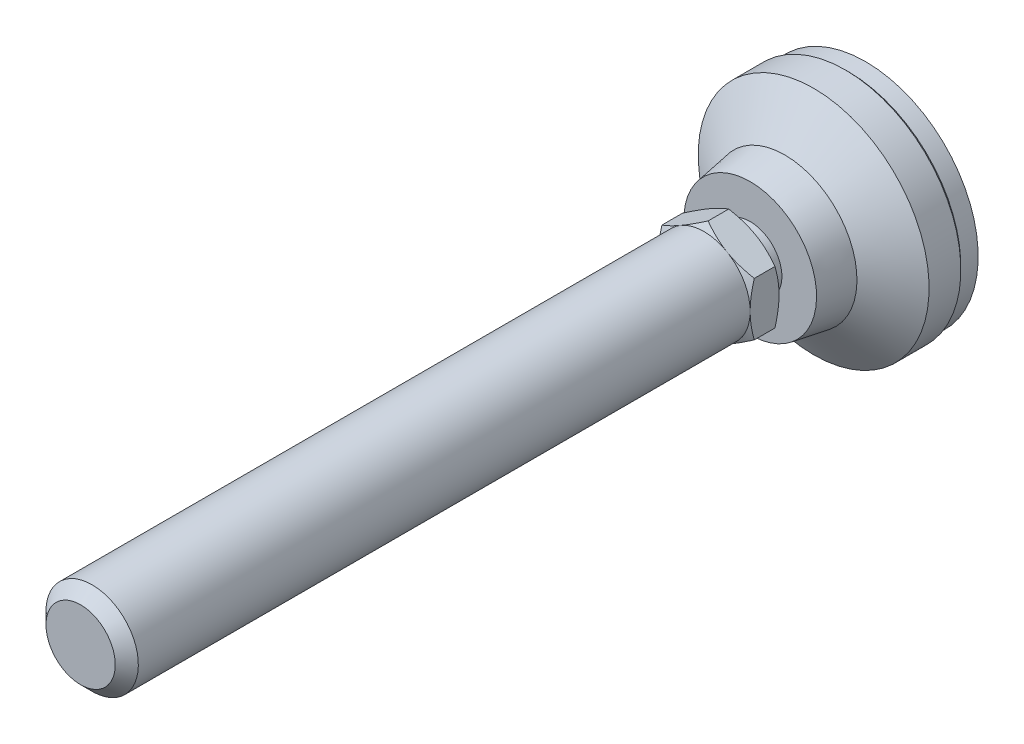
ISO-10303-21;
HEADER;
FILE_DESCRIPTION(('STEP AP214'),'2;1');
FILE_NAME('part.step','',(''),(''),'','','');
FILE_SCHEMA(('AUTOMOTIVE_DESIGN { 1 0 10303 214 1 1 1 1 }'));
ENDSEC;
DATA;
#1=APPLICATION_CONTEXT('core data for automotive mechanical design processes');
#2=APPLICATION_PROTOCOL_DEFINITION('international standard','automotive_design',2000,#1);
#3=PRODUCT_CONTEXT('',#1,'mechanical');
#4=PRODUCT('Part','Part','',(#3));
#5=PRODUCT_RELATED_PRODUCT_CATEGORY('part','',(#4));
#6=PRODUCT_DEFINITION_FORMATION('','',#4);
#7=PRODUCT_DEFINITION_CONTEXT('part definition',#1,'design');
#8=PRODUCT_DEFINITION('design','',#6,#7);
#9=PRODUCT_DEFINITION_SHAPE('','',#8);
#10=(LENGTH_UNIT() NAMED_UNIT(*) SI_UNIT(.MILLI.,.METRE.));
#11=(NAMED_UNIT(*) PLANE_ANGLE_UNIT() SI_UNIT($,.RADIAN.));
#12=(NAMED_UNIT(*) SI_UNIT($,.STERADIAN.) SOLID_ANGLE_UNIT());
#13=UNCERTAINTY_MEASURE_WITH_UNIT(LENGTH_MEASURE(1.E-05),#10,'distance_accuracy_value','');
#14=(GEOMETRIC_REPRESENTATION_CONTEXT(3) GLOBAL_UNCERTAINTY_ASSIGNED_CONTEXT((#13)) GLOBAL_UNIT_ASSIGNED_CONTEXT((#10,
#11,#12)) REPRESENTATION_CONTEXT('',''));
#15=CARTESIAN_POINT('',(0.,0.,0.));
#16=DIRECTION('',(0.,0.,1.));
#17=DIRECTION('',(1.,0.,0.));
#18=AXIS2_PLACEMENT_3D('',#15,#16,#17);
#19=CARTESIAN_POINT('',(0.,0.,2.));
#20=DIRECTION('',(0.,0.,-1.));
#21=DIRECTION('',(0.,1.,0.));
#22=AXIS2_PLACEMENT_3D('',#19,#20,#21);
#23=CYLINDRICAL_SURFACE('',#22,20.);
#24=CARTESIAN_POINT('',(0.,0.,3.5));
#25=DIRECTION('',(0.,0.,-1.));
#26=DIRECTION('',(0.,1.,0.));
#27=AXIS2_PLACEMENT_3D('',#24,#25,#26);
#28=CIRCLE('',#27,20.);
#29=CARTESIAN_POINT('',(0.,20.,3.5));
#30=VERTEX_POINT('',#29);
#31=EDGE_CURVE('E163',#30,#30,#28,.F.);
#32=ORIENTED_EDGE('',*,*,#31,.T.);
#33=EDGE_LOOP('',(#32));
#34=FACE_BOUND('',#33,.T.);
#35=CARTESIAN_POINT('',(0.,0.,9.));
#36=DIRECTION('',(0.,0.,-1.));
#37=DIRECTION('',(0.,1.,0.));
#38=AXIS2_PLACEMENT_3D('',#35,#36,#37);
#39=CIRCLE('',#38,20.);
#40=CARTESIAN_POINT('',(0.,20.,9.));
#41=VERTEX_POINT('',#40);
#42=EDGE_CURVE('E143',#41,#41,#39,.T.);
#43=ORIENTED_EDGE('',*,*,#42,.T.);
#44=EDGE_LOOP('',(#43));
#45=FACE_BOUND('',#44,.T.);
#46=ADVANCED_FACE('F14',(#34,#45),#23,.T.);
#47=CARTESIAN_POINT('',(0.,0.,2.));
#48=DIRECTION('',(0.,0.,-1.));
#49=DIRECTION('',(0.,1.,0.));
#50=AXIS2_PLACEMENT_3D('',#47,#48,#49);
#51=CYLINDRICAL_SURFACE('',#50,5.50000000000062);
#52=CARTESIAN_POINT('',(0.,0.,20.));
#53=DIRECTION('',(0.,0.,-1.));
#54=DIRECTION('',(0.,1.,0.));
#55=AXIS2_PLACEMENT_3D('',#52,#53,#54);
#56=CIRCLE('',#55,5.50000000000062);
#57=CARTESIAN_POINT('',(0.,5.50000000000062,20.));
#58=VERTEX_POINT('',#57);
#59=EDGE_CURVE('E153',#58,#58,#56,.T.);
#60=ORIENTED_EDGE('',*,*,#59,.F.);
#61=EDGE_LOOP('',(#60));
#62=FACE_BOUND('',#61,.T.);
#63=CARTESIAN_POINT('',(0.,0.,22.9999999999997));
#64=DIRECTION('',(0.,0.,-1.));
#65=DIRECTION('',(0.,1.,0.));
#66=AXIS2_PLACEMENT_3D('',#63,#64,#65);
#67=CIRCLE('',#66,5.50000000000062);
#68=CARTESIAN_POINT('',(0.,5.50000000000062,22.9999999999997));
#69=VERTEX_POINT('',#68);
#70=EDGE_CURVE('E134',#69,#69,#67,.T.);
#71=ORIENTED_EDGE('',*,*,#70,.T.);
#72=EDGE_LOOP('',(#71));
#73=FACE_BOUND('',#72,.T.);
#74=ADVANCED_FACE('F293',(#62,#73),#51,.T.);
#75=CARTESIAN_POINT('',(-11.5,0.,20.));
#76=DIRECTION('',(0.,0.,-1.));
#77=DIRECTION('',(0.,1.,0.));
#78=AXIS2_PLACEMENT_3D('',#75,#76,#77);
#79=PLANE('',#78);
#80=CARTESIAN_POINT('',(0.,0.,20.));
#81=DIRECTION('',(0.,0.,-1.));
#82=DIRECTION('',(0.,1.,0.));
#83=AXIS2_PLACEMENT_3D('',#80,#81,#82);
#84=CIRCLE('',#83,11.5);
#85=CARTESIAN_POINT('',(0.,11.5,20.));
#86=VERTEX_POINT('',#85);
#87=EDGE_CURVE('E150',#86,#86,#84,.T.);
#88=ORIENTED_EDGE('',*,*,#87,.F.);
#89=EDGE_LOOP('',(#88));
#90=FACE_BOUND('',#89,.T.);
#91=ORIENTED_EDGE('',*,*,#59,.T.);
#92=EDGE_LOOP('',(#91));
#93=FACE_BOUND('',#92,.T.);
#94=ADVANCED_FACE('F299',(#90,#93),#79,.F.);
#95=CARTESIAN_POINT('',(0.,0.,20.));
#96=DIRECTION('',(0.,0.,-1.));
#97=DIRECTION('',(0.,1.,0.));
#98=AXIS2_PLACEMENT_3D('',#95,#96,#97);
#99=CONICAL_SURFACE('',#98,11.5,0.165148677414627);
#100=CARTESIAN_POINT('',(0.,0.,14.));
#101=DIRECTION('',(0.,0.,-1.));
#102=DIRECTION('',(0.,1.,0.));
#103=AXIS2_PLACEMENT_3D('',#100,#101,#102);
#104=CIRCLE('',#103,12.5);
#105=CARTESIAN_POINT('',(0.,12.5,14.));
#106=VERTEX_POINT('',#105);
#107=EDGE_CURVE('E146',#106,#106,#104,.T.);
#108=ORIENTED_EDGE('',*,*,#107,.F.);
#109=EDGE_LOOP('',(#108));
#110=FACE_BOUND('',#109,.T.);
#111=ORIENTED_EDGE('',*,*,#87,.T.);
#112=EDGE_LOOP('',(#111));
#113=FACE_BOUND('',#112,.T.);
#114=ADVANCED_FACE('F308',(#110,#113),#99,.T.);
#115=CARTESIAN_POINT('',(0.,0.,14.));
#116=DIRECTION('',(0.,0.,-1.));
#117=DIRECTION('',(0.,1.,0.));
#118=AXIS2_PLACEMENT_3D('',#115,#116,#117);
#119=CONICAL_SURFACE('',#118,12.5,0.982793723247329);
#120=ORIENTED_EDGE('',*,*,#42,.F.);
#121=EDGE_LOOP('',(#120));
#122=FACE_BOUND('',#121,.T.);
#123=ORIENTED_EDGE('',*,*,#107,.T.);
#124=EDGE_LOOP('',(#123));
#125=FACE_BOUND('',#124,.T.);
#126=ADVANCED_FACE('F304',(#122,#125),#119,.T.);
#127=CARTESIAN_POINT('',(0.,-5.50000000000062,22.9999999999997));
#128=DIRECTION('',(0.,0.,-1.));
#129=DIRECTION('',(0.,1.,0.));
#130=AXIS2_PLACEMENT_3D('',#127,#128,#129);
#131=PLANE('',#130);
#132=CARTESIAN_POINT('',(0.,0.,22.9999999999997));
#133=DIRECTION('',(0.,0.,1.));
#134=DIRECTION('',(0.,-1.,0.));
#135=AXIS2_PLACEMENT_3D('',#132,#133,#134);
#136=CIRCLE('',#135,8.00000000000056);
#137=CARTESIAN_POINT('',(-4.,6.92820323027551,22.9999999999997));
#138=VERTEX_POINT('',#137);
#139=CARTESIAN_POINT('',(-8.,0.,22.9999999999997));
#140=VERTEX_POINT('',#139);
#141=EDGE_CURVE('E374',#138,#140,#136,.T.);
#142=ORIENTED_EDGE('',*,*,#141,.F.);
#143=CARTESIAN_POINT('',(4.,6.92820323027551,22.9999999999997));
#144=VERTEX_POINT('',#143);
#145=EDGE_CURVE('E115',#144,#138,#136,.T.);
#146=ORIENTED_EDGE('',*,*,#145,.F.);
#147=CARTESIAN_POINT('',(8.,0.,22.9999999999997));
#148=VERTEX_POINT('',#147);
#149=EDGE_CURVE('E375',#148,#144,#136,.T.);
#150=ORIENTED_EDGE('',*,*,#149,.F.);
#151=CARTESIAN_POINT('',(4.,-6.92820323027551,22.9999999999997));
#152=VERTEX_POINT('',#151);
#153=EDGE_CURVE('E35',#152,#148,#136,.T.);
#154=ORIENTED_EDGE('',*,*,#153,.F.);
#155=CARTESIAN_POINT('',(-4.,-6.92820323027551,22.9999999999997));
#156=VERTEX_POINT('',#155);
#157=EDGE_CURVE('E43',#156,#152,#136,.T.);
#158=ORIENTED_EDGE('',*,*,#157,.F.);
#159=EDGE_CURVE('E367',#140,#156,#136,.T.);
#160=ORIENTED_EDGE('',*,*,#159,.F.);
#161=EDGE_LOOP('',(#142,#146,#150,#154,#158,#160));
#162=FACE_BOUND('',#161,.T.);
#163=ORIENTED_EDGE('',*,*,#70,.F.);
#164=EDGE_LOOP('',(#163));
#165=FACE_BOUND('',#164,.T.);
#166=ADVANCED_FACE('F307',(#162,#165),#131,.T.);
#167=CARTESIAN_POINT('',(0.,0.,3.));
#168=DIRECTION('',(0.,0.,1.));
#169=DIRECTION('',(0.,-1.,0.));
#170=AXIS2_PLACEMENT_3D('',#167,#168,#169);
#171=CONICAL_SURFACE('',#170,19.5,0.785398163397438);
#172=ORIENTED_EDGE('',*,*,#31,.F.);
#173=EDGE_LOOP('',(#172));
#174=FACE_BOUND('',#173,.T.);
#175=CARTESIAN_POINT('',(0.,0.,3.));
#176=DIRECTION('',(0.,0.,-1.));
#177=DIRECTION('',(0.,1.,0.));
#178=AXIS2_PLACEMENT_3D('',#175,#176,#177);
#179=CIRCLE('',#178,19.5);
#180=CARTESIAN_POINT('',(0.,19.5,3.));
#181=VERTEX_POINT('',#180);
#182=EDGE_CURVE('E160',#181,#181,#179,.T.);
#183=ORIENTED_EDGE('',*,*,#182,.F.);
#184=EDGE_LOOP('',(#183));
#185=FACE_BOUND('',#184,.T.);
#186=ADVANCED_FACE('F16',(#174,#185),#171,.T.);
#187=CARTESIAN_POINT('',(0.,0.,0.));
#188=DIRECTION('',(0.,0.,1.));
#189=DIRECTION('',(0.,-1.,0.));
#190=AXIS2_PLACEMENT_3D('',#187,#188,#189);
#191=CYLINDRICAL_SURFACE('',#190,19.5);
#192=CARTESIAN_POINT('',(0.,0.,0.));
#193=DIRECTION('',(0.,0.,-1.));
#194=DIRECTION('',(0.,1.,0.));
#195=AXIS2_PLACEMENT_3D('',#192,#193,#194);
#196=CIRCLE('',#195,19.5);
#197=CARTESIAN_POINT('',(0.,19.5,0.));
#198=VERTEX_POINT('',#197);
#199=EDGE_CURVE('E406',#198,#198,#196,.T.);
#200=ORIENTED_EDGE('',*,*,#199,.F.);
#201=EDGE_LOOP('',(#200));
#202=FACE_BOUND('',#201,.T.);
#203=ORIENTED_EDGE('',*,*,#182,.T.);
#204=EDGE_LOOP('',(#203));
#205=FACE_BOUND('',#204,.T.);
#206=ADVANCED_FACE('F335',(#202,#205),#191,.T.);
#207=CARTESIAN_POINT('',(0.,0.,0.));
#208=DIRECTION('',(0.,0.,-1.));
#209=DIRECTION('',(0.,1.,0.));
#210=AXIS2_PLACEMENT_3D('',#207,#208,#209);
#211=PLANE('',#210);
#212=ORIENTED_EDGE('',*,*,#199,.T.);
#213=EDGE_LOOP('',(#212));
#214=FACE_BOUND('',#213,.T.);
#215=ADVANCED_FACE('F183',(#214),#211,.T.);
#216=CARTESIAN_POINT('',(0.,0.,22.9999999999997));
#217=DIRECTION('',(0.,0.,1.));
#218=DIRECTION('',(0.,-1.,0.));
#219=AXIS2_PLACEMENT_3D('',#216,#217,#218);
#220=CONICAL_SURFACE('',#219,8.00000000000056,1.0471975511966);
#221=CARTESIAN_POINT('',(-0.00019999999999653,9.23771977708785,23.7145978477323));
#222=CARTESIAN_POINT('',(0.1756487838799,9.13619343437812,23.6559907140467));
#223=CARTESIAN_POINT('',(0.352153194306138,9.03428856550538,23.6000434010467));
#224=CARTESIAN_POINT('',(0.706595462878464,8.82965122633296,23.494201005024));
#225=CARTESIAN_POINT('',(0.884533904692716,8.72691841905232,23.4443085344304));
#226=CARTESIAN_POINT('',(1.42119823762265,8.41707512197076,23.3046927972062));
#227=CARTESIAN_POINT('',(1.78204258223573,8.20874154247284,23.2252811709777));
#228=CARTESIAN_POINT('',(2.32203917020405,7.89697436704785,23.1321616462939));
#229=CARTESIAN_POINT('',(2.49957818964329,7.79447216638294,23.1056345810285));
#230=CARTESIAN_POINT('',(2.8554591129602,7.58900421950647,23.0611531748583));
#231=CARTESIAN_POINT('',(3.03380094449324,7.4860385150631,23.043198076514));
#232=CARTESIAN_POINT('',(3.3907916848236,7.27992981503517,23.0163156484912));
#233=CARTESIAN_POINT('',(3.5694400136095,7.17678715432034,23.0073780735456));
#234=CARTESIAN_POINT('',(3.92690170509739,6.97040655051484,22.9987223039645));
#235=CARTESIAN_POINT('',(4.10571506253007,6.86716861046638,22.9990038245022));
#236=CARTESIAN_POINT('',(4.44001336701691,6.67416139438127,23.0081450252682));
#237=CARTESIAN_POINT('',(4.59552190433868,6.58437849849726,23.0158896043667));
#238=CARTESIAN_POINT('',(4.90617476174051,6.40502298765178,23.0382011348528));
#239=CARTESIAN_POINT('',(5.06131905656,6.31545038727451,23.0527685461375));
#240=CARTESIAN_POINT('',(5.52615131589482,6.04707935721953,23.1063606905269));
#241=CARTESIAN_POINT('',(5.83501648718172,5.86875596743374,23.1552686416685));
#242=CARTESIAN_POINT('',(6.4560232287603,5.51021755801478,23.2775394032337));
#243=CARTESIAN_POINT('',(6.76808554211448,5.3300482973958,23.3514205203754));
#244=CARTESIAN_POINT('',(7.38755648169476,4.97239658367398,23.5191001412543));
#245=CARTESIAN_POINT('',(7.69497304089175,4.79490955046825,23.6128592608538));
#246=CARTESIAN_POINT('',(8.0002,4.61868668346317,23.7145978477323));
#247=B_SPLINE_CURVE_WITH_KNOTS('',3,(#221,#222,#223,#224,#225,#226,#227,#228,#229,#230,#231,
#232,#233,#234,#235,#236,#237,#238,#239,#240,#241,#242,#243,#244,#245,#246),.UNSPECIFIED.,.F.,
.F.,(4,2,2,2,2,2,2,2,2,2,2,2,4),(0.,0.633973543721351,1.26821965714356,2.53934712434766,
3.15934343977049,3.77928496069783,4.39852133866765,5.01773858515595,5.55680239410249,
6.09590254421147,7.17487077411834,8.27776850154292,9.37850115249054),.UNSPECIFIED.);
#248=CARTESIAN_POINT('',(0.,9.23760430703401,23.7145311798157));
#249=VERTEX_POINT('',#248);
#250=EDGE_CURVE('E112',#249,#144,#247,.T.);
#251=ORIENTED_EDGE('',*,*,#250,.T.);
#252=ORIENTED_EDGE('',*,*,#145,.T.);
#253=CARTESIAN_POINT('',(-8.0002,4.61868668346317,23.7145978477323));
#254=CARTESIAN_POINT('',(-7.8243512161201,4.7202130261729,23.6559907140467));
#255=CARTESIAN_POINT('',(-7.64784680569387,4.82211789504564,23.6000434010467));
#256=CARTESIAN_POINT('',(-7.29340453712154,5.02675523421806,23.494201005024));
#257=CARTESIAN_POINT('',(-7.11546609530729,5.1294880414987,23.4443085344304));
#258=CARTESIAN_POINT('',(-6.57880176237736,5.43933133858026,23.3046927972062));
#259=CARTESIAN_POINT('',(-6.21795741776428,5.64766491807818,23.2252811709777));
#260=CARTESIAN_POINT('',(-5.67796082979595,5.95943209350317,23.1321616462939));
#261=CARTESIAN_POINT('',(-5.50042181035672,6.06193429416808,23.1056345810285));
#262=CARTESIAN_POINT('',(-5.1445408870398,6.26740224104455,23.0611531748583));
#263=CARTESIAN_POINT('',(-4.96619905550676,6.37036794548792,23.043198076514));
#264=CARTESIAN_POINT('',(-4.60920831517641,6.57647664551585,23.0163156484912));
#265=CARTESIAN_POINT('',(-4.4305599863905,6.67961930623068,23.0073780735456));
#266=CARTESIAN_POINT('',(-4.07309829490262,6.88599991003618,22.9987223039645));
#267=CARTESIAN_POINT('',(-3.89428493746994,6.98923785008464,22.9990038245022));
#268=CARTESIAN_POINT('',(-3.5599866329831,7.18224506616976,23.0081450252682));
#269=CARTESIAN_POINT('',(-3.40447809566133,7.27202796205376,23.0158896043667));
#270=CARTESIAN_POINT('',(-3.09382523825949,7.45138347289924,23.0382011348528));
#271=CARTESIAN_POINT('',(-2.93868094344,7.54095607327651,23.0527685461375));
#272=CARTESIAN_POINT('',(-2.47384868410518,7.80932710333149,23.1063606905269));
#273=CARTESIAN_POINT('',(-2.16498351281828,7.98765049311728,23.1552686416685));
#274=CARTESIAN_POINT('',(-1.5439767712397,8.34618890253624,23.2775394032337));
#275=CARTESIAN_POINT('',(-1.23191445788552,8.52635816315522,23.3514205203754));
#276=CARTESIAN_POINT('',(-0.612443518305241,8.88400987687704,23.5191001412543));
#277=CARTESIAN_POINT('',(-0.305026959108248,9.06149691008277,23.6128592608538));
#278=CARTESIAN_POINT('',(0.000200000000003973,9.23771977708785,23.7145978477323));
#279=B_SPLINE_CURVE_WITH_KNOTS('',3,(#253,#254,#255,#256,#257,#258,#259,#260,#261,#262,#263,
#264,#265,#266,#267,#268,#269,#270,#271,#272,#273,#274,#275,#276,#277,#278),.UNSPECIFIED.,.F.,
.F.,(4,2,2,2,2,2,2,2,2,2,2,2,4),(0.,0.63397354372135,1.26821965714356,2.53934712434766,
3.15934343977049,3.77928496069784,4.39852133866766,5.01773858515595,5.55680239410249,
6.09590254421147,7.17487077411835,8.27776850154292,9.37850115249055),.UNSPECIFIED.);
#280=EDGE_CURVE('E18',#138,#249,#279,.T.);
#281=ORIENTED_EDGE('',*,*,#280,.T.);
#282=EDGE_LOOP('',(#251,#252,#281));
#283=FACE_BOUND('',#282,.T.);
#284=ADVANCED_FACE('F111',(#283),#220,.T.);
#285=CARTESIAN_POINT('',(-8.,12.3263124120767,26.8652608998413));
#286=CARTESIAN_POINT('',(-8.,11.9775694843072,26.6964140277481));
#287=CARTESIAN_POINT('',(-8.,11.6280173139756,26.5292095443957));
#288=CARTESIAN_POINT('',(-8.,10.926863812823,26.1990107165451));
#289=CARTESIAN_POINT('',(-8.,10.5752621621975,26.0360170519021));
#290=CARTESIAN_POINT('',(-8.,9.86772854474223,25.7143278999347));
#291=CARTESIAN_POINT('',(-8.,9.51178336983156,25.5556613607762));
#292=CARTESIAN_POINT('',(-8.,8.79703376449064,25.2449296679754));
#293=CARTESIAN_POINT('',(-8.,8.43822947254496,25.0928641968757));
#294=CARTESIAN_POINT('',(-8.,7.70591549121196,24.7924548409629));
#295=CARTESIAN_POINT('',(-8.,7.33229660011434,24.6443756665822));
#296=CARTESIAN_POINT('',(-8.,6.58065902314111,24.3596203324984));
#297=CARTESIAN_POINT('',(-8.,6.20263984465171,24.2229454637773));
#298=CARTESIAN_POINT('',(-8.,5.44232968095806,23.96464628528));
#299=CARTESIAN_POINT('',(-8.,5.06004940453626,23.8429907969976));
#300=CARTESIAN_POINT('',(-8.,4.29002015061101,23.61868525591));
#301=CARTESIAN_POINT('',(-8.,3.90227296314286,23.5160291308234));
#302=CARTESIAN_POINT('',(-8.,3.12316558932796,23.3352511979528));
#303=CARTESIAN_POINT('',(-8.,2.73183647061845,23.2569991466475));
#304=CARTESIAN_POINT('',(-8.,2.14134438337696,23.1613507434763));
#305=CARTESIAN_POINT('',(-8.,1.94391546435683,23.1330882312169));
#306=CARTESIAN_POINT('',(-8.,1.54810388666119,23.0843625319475));
#307=CARTESIAN_POINT('',(-8.,1.34972132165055,23.0638985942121));
#308=CARTESIAN_POINT('',(-8.,0.95482390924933,23.031430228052));
#309=CARTESIAN_POINT('',(-8.,0.758317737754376,23.019320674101));
#310=CARTESIAN_POINT('',(-8.,0.364969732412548,23.0034165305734));
#311=CARTESIAN_POINT('',(-8.,0.16812790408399,22.9996218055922));
#312=CARTESIAN_POINT('',(-8.,-0.225540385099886,23.0004376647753));
#313=CARTESIAN_POINT('',(-8.,-0.422366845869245,23.0050482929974));
#314=CARTESIAN_POINT('',(-8.,-0.815652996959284,23.0225635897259));
#315=CARTESIAN_POINT('',(-8.,-1.0121126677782,23.0354686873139));
#316=CARTESIAN_POINT('',(-8.,-1.48673995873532,23.0763953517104));
#317=CARTESIAN_POINT('',(-8.,-1.76456354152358,23.1084896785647));
#318=CARTESIAN_POINT('',(-8.,-2.31808232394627,23.1874957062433));
#319=CARTESIAN_POINT('',(-8.,-2.59377721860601,23.2344094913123));
#320=CARTESIAN_POINT('',(-8.,-3.4173917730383,23.3948866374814));
#321=CARTESIAN_POINT('',(-8.,-3.96151921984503,23.5281544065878));
#322=CARTESIAN_POINT('',(-8.,-4.77500840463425,23.7584087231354));
#323=CARTESIAN_POINT('',(-8.,-5.04861098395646,23.8412670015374));
#324=CARTESIAN_POINT('',(-8.,-5.59315750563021,24.0153800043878));
#325=CARTESIAN_POINT('',(-8.,-5.86410143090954,24.1066347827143));
#326=CARTESIAN_POINT('',(-8.,-6.40341975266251,24.2960941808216));
#327=CARTESIAN_POINT('',(-8.,-6.67179501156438,24.394296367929));
#328=CARTESIAN_POINT('',(-8.,-7.20633641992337,24.5965161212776));
#329=CARTESIAN_POINT('',(-8.,-7.47250259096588,24.7005336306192));
#330=CARTESIAN_POINT('',(-8.,-8.08229087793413,24.9452921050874));
#331=CARTESIAN_POINT('',(-8.,-8.42524129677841,25.0877030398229));
#332=CARTESIAN_POINT('',(-8.,-9.10837038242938,25.3790415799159));
#333=CARTESIAN_POINT('',(-8.,-9.44854890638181,25.5279695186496));
#334=CARTESIAN_POINT('',(-8.,-10.1266267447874,25.8310867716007));
#335=CARTESIAN_POINT('',(-8.,-10.4645256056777,25.9852770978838));
#336=CARTESIAN_POINT('',(-8.,-11.138343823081,26.2979000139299));
#337=CARTESIAN_POINT('',(-8.,-11.474263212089,26.4563325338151));
#338=CARTESIAN_POINT('',(-8.,-12.1447441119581,26.7768201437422));
#339=CARTESIAN_POINT('',(-8.,-12.4793041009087,26.9388784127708));
#340=CARTESIAN_POINT('',(-8.,-13.1470121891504,27.2658803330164));
#341=CARTESIAN_POINT('',(-8.,-13.4801602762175,27.4308240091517));
#342=CARTESIAN_POINT('',(-8.,-14.4778271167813,27.9292484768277));
#343=CARTESIAN_POINT('',(-8.,-15.140554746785,28.2663161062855));
#344=CARTESIAN_POINT('',(-8.,-16.105765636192,28.7635077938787));
#345=CARTESIAN_POINT('',(-8.,-16.4096389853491,28.920950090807));
#346=CARTESIAN_POINT('',(-8.,-17.0167225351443,29.2370965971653));
#347=CARTESIAN_POINT('',(-8.,-17.3199327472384,29.3958007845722));
#348=CARTESIAN_POINT('',(-8.,-18.22872348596,29.8735656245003));
#349=CARTESIAN_POINT('',(-8.,-18.8334414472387,30.1942668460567));
#350=CARTESIAN_POINT('',(-8.,-20.0397084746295,30.8382873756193));
#351=CARTESIAN_POINT('',(-8.,-20.6412616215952,31.1615990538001));
#352=CARTESIAN_POINT('',(-8.,-21.8428985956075,31.8108702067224));
#353=CARTESIAN_POINT('',(-8.,-22.4429824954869,32.1368295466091));
#354=CARTESIAN_POINT('',(-8.,-23.0425200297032,32.4637843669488));
#355=B_SPLINE_CURVE_WITH_KNOTS('',3,(#285,#286,#287,#288,#289,#290,#291,#292,#293,#294,#295,
#296,#297,#298,#299,#300,#301,#302,#303,#304,#305,#306,#307,#308,#309,#310,#311,#312,#313,#314,
#315,#316,#317,#318,#319,#320,#321,#322,#323,#324,#325,#326,#327,#328,#329,#330,#331,#332,#333,
#334,#335,#336,#337,#338,#339,#340,#341,#342,#343,#344,#345,#346,#347,#348,#349,#350,#351,#352,
#353,#354),.UNSPECIFIED.,.F.,.F.,(4,2,2,2,2,2,2,2,2,2,2,2,2,2,2,2,2,2,2,2,2,2,2,2,2,2,2,2,2,2,2,
2,2,2,4),(0.,1.16241643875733,2.32501939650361,3.49408862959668,4.66310157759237,
5.86863817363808,7.07431105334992,8.27743743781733,9.48017863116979,10.6763864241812,
11.274581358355,11.8727186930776,12.4631850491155,13.0536417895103,13.6441016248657,
14.2345920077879,15.0731300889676,15.9117861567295,17.590064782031,18.4476176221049,
19.3051759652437,20.1624355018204,21.0196866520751,22.1336278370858,23.2476260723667,
24.3618397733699,25.4760351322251,26.5912489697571,27.7064724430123,29.9369650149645,
30.9636790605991,31.9903752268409,34.0438440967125,36.0926343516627,38.1413209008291),.UNSPECIFIED.);
#356=CARTESIAN_POINT('',(-8.,4.61880215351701,23.7145311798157));
#357=VERTEX_POINT('',#356);
#358=EDGE_CURVE('E347',#140,#357,#355,.F.);
#359=ORIENTED_EDGE('',*,*,#358,.T.);
#360=EDGE_CURVE('E9',#357,#138,#279,.T.);
#361=ORIENTED_EDGE('',*,*,#360,.T.);
#362=ORIENTED_EDGE('',*,*,#141,.T.);
#363=EDGE_LOOP('',(#359,#361,#362));
#364=FACE_BOUND('',#363,.T.);
#365=ADVANCED_FACE('F181',(#364),#220,.T.);
#366=CARTESIAN_POINT('',(0.000200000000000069,-9.23771977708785,23.7145978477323));
#367=CARTESIAN_POINT('',(-0.175648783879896,-9.13619343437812,23.6559907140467));
#368=CARTESIAN_POINT('',(-0.352153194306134,-9.03428856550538,23.6000434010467));
#369=CARTESIAN_POINT('',(-0.706595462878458,-8.82965122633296,23.494201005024));
#370=CARTESIAN_POINT('',(-0.88453390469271,-8.72691841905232,23.4443085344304));
#371=CARTESIAN_POINT('',(-1.42119823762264,-8.41707512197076,23.3046927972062));
#372=CARTESIAN_POINT('',(-1.78204258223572,-8.20874154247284,23.2252811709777));
#373=CARTESIAN_POINT('',(-2.32203917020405,-7.89697436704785,23.1321616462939));
#374=CARTESIAN_POINT('',(-2.49957818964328,-7.79447216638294,23.1056345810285));
#375=CARTESIAN_POINT('',(-2.8554591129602,-7.58900421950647,23.0611531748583));
#376=CARTESIAN_POINT('',(-3.03380094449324,-7.4860385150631,23.043198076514));
#377=CARTESIAN_POINT('',(-3.39079168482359,-7.27992981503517,23.0163156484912));
#378=CARTESIAN_POINT('',(-3.5694400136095,-7.17678715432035,23.0073780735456));
#379=CARTESIAN_POINT('',(-3.92690170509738,-6.97040655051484,22.9987223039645));
#380=CARTESIAN_POINT('',(-4.10571506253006,-6.86716861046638,22.9990038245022));
#381=CARTESIAN_POINT('',(-4.4400133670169,-6.67416139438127,23.0081450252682));
#382=CARTESIAN_POINT('',(-4.59552190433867,-6.58437849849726,23.0158896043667));
#383=CARTESIAN_POINT('',(-4.90617476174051,-6.40502298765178,23.0382011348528));
#384=CARTESIAN_POINT('',(-5.06131905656,-6.31545038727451,23.0527685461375));
#385=CARTESIAN_POINT('',(-5.52615131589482,-6.04707935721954,23.1063606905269));
#386=CARTESIAN_POINT('',(-5.83501648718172,-5.86875596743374,23.1552686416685));
#387=CARTESIAN_POINT('',(-6.4560232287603,-5.51021755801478,23.2775394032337));
#388=CARTESIAN_POINT('',(-6.76808554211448,-5.3300482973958,23.3514205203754));
#389=CARTESIAN_POINT('',(-7.38755648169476,-4.97239658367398,23.5191001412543));
#390=CARTESIAN_POINT('',(-7.69497304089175,-4.79490955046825,23.6128592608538));
#391=CARTESIAN_POINT('',(-8.0002,-4.61868668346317,23.7145978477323));
#392=B_SPLINE_CURVE_WITH_KNOTS('',3,(#366,#367,#368,#369,#370,#371,#372,#373,#374,#375,#376,
#377,#378,#379,#380,#381,#382,#383,#384,#385,#386,#387,#388,#389,#390,#391),.UNSPECIFIED.,.F.,
.F.,(4,2,2,2,2,2,2,2,2,2,2,2,4),(0.,0.633973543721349,1.26821965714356,2.53934712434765,
3.15934343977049,3.77928496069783,4.39852133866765,5.01773858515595,5.55680239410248,
6.09590254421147,7.17487077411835,8.27776850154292,9.37850115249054),.UNSPECIFIED.);
#393=CARTESIAN_POINT('',(-8.,-4.618802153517,23.7145311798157));
#394=VERTEX_POINT('',#393);
#395=EDGE_CURVE('E354',#156,#394,#392,.T.);
#396=ORIENTED_EDGE('',*,*,#395,.T.);
#397=EDGE_CURVE('E353',#394,#140,#355,.F.);
#398=ORIENTED_EDGE('',*,*,#397,.T.);
#399=ORIENTED_EDGE('',*,*,#159,.T.);
#400=EDGE_LOOP('',(#396,#398,#399));
#401=FACE_BOUND('',#400,.T.);
#402=ADVANCED_FACE('F365',(#401),#220,.T.);
#403=CARTESIAN_POINT('',(8.0002,-4.61868668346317,23.7145978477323));
#404=CARTESIAN_POINT('',(7.8243512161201,-4.7202130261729,23.6559907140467));
#405=CARTESIAN_POINT('',(7.64784680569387,-4.82211789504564,23.6000434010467));
#406=CARTESIAN_POINT('',(7.29340453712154,-5.02675523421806,23.494201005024));
#407=CARTESIAN_POINT('',(7.11546609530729,-5.1294880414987,23.4443085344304));
#408=CARTESIAN_POINT('',(6.57880176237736,-5.43933133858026,23.3046927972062));
#409=CARTESIAN_POINT('',(6.21795741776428,-5.64766491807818,23.2252811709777));
#410=CARTESIAN_POINT('',(5.67796082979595,-5.95943209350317,23.1321616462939));
#411=CARTESIAN_POINT('',(5.50042181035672,-6.06193429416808,23.1056345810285));
#412=CARTESIAN_POINT('',(5.1445408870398,-6.26740224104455,23.0611531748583));
#413=CARTESIAN_POINT('',(4.96619905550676,-6.37036794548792,23.043198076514));
#414=CARTESIAN_POINT('',(4.60920831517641,-6.57647664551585,23.0163156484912));
#415=CARTESIAN_POINT('',(4.4305599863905,-6.67961930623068,23.0073780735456));
#416=CARTESIAN_POINT('',(4.07309829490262,-6.88599991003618,22.9987223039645));
#417=CARTESIAN_POINT('',(3.89428493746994,-6.98923785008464,22.9990038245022));
#418=CARTESIAN_POINT('',(3.5599866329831,-7.18224506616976,23.0081450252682));
#419=CARTESIAN_POINT('',(3.40447809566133,-7.27202796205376,23.0158896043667));
#420=CARTESIAN_POINT('',(3.09382523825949,-7.45138347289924,23.0382011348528));
#421=CARTESIAN_POINT('',(2.93868094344,-7.54095607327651,23.0527685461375));
#422=CARTESIAN_POINT('',(2.47384868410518,-7.80932710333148,23.1063606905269));
#423=CARTESIAN_POINT('',(2.16498351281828,-7.98765049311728,23.1552686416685));
#424=CARTESIAN_POINT('',(1.5439767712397,-8.34618890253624,23.2775394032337));
#425=CARTESIAN_POINT('',(1.23191445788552,-8.52635816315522,23.3514205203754));
#426=CARTESIAN_POINT('',(0.612443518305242,-8.88400987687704,23.5191001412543));
#427=CARTESIAN_POINT('',(0.30502695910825,-9.06149691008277,23.6128592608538));
#428=CARTESIAN_POINT('',(-0.000200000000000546,-9.23771977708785,23.7145978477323));
#429=B_SPLINE_CURVE_WITH_KNOTS('',3,(#403,#404,#405,#406,#407,#408,#409,#410,#411,#412,#413,
#414,#415,#416,#417,#418,#419,#420,#421,#422,#423,#424,#425,#426,#427,#428),.UNSPECIFIED.,.F.,
.F.,(4,2,2,2,2,2,2,2,2,2,2,2,4),(0.,0.63397354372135,1.26821965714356,2.53934712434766,
3.15934343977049,3.77928496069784,4.39852133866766,5.01773858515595,5.55680239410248,
6.09590254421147,7.17487077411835,8.27776850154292,9.37850115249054),.UNSPECIFIED.);
#430=CARTESIAN_POINT('',(0.,-9.23760430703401,23.7145311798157));
#431=VERTEX_POINT('',#430);
#432=EDGE_CURVE('E244',#152,#431,#429,.T.);
#433=ORIENTED_EDGE('',*,*,#432,.T.);
#434=EDGE_CURVE('E359',#431,#156,#392,.T.);
#435=ORIENTED_EDGE('',*,*,#434,.T.);
#436=ORIENTED_EDGE('',*,*,#157,.T.);
#437=EDGE_LOOP('',(#433,#435,#436));
#438=FACE_BOUND('',#437,.T.);
#439=ADVANCED_FACE('F390',(#438),#220,.T.);
#440=CARTESIAN_POINT('',(8.,12.3263124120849,26.8652608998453));
#441=CARTESIAN_POINT('',(8.,11.9775694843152,26.6964140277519));
#442=CARTESIAN_POINT('',(8.,11.6280173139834,26.5292095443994));
#443=CARTESIAN_POINT('',(8.,10.9268638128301,26.1990107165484));
#444=CARTESIAN_POINT('',(8.,10.5752621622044,26.0360170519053));
#445=CARTESIAN_POINT('',(8.,9.86772854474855,25.7143278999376));
#446=CARTESIAN_POINT('',(8.,9.51178336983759,25.5556613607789));
#447=CARTESIAN_POINT('',(8.,8.7970337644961,25.2449296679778));
#448=CARTESIAN_POINT('',(8.,8.43822947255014,25.0928641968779));
#449=CARTESIAN_POINT('',(8.,7.70591549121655,24.7924548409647));
#450=CARTESIAN_POINT('',(8.,7.33229660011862,24.6443756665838));
#451=CARTESIAN_POINT('',(8.,6.58065902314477,24.3596203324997));
#452=CARTESIAN_POINT('',(8.,6.20263984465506,24.2229454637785));
#453=CARTESIAN_POINT('',(8.,5.44232968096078,23.9646462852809));
#454=CARTESIAN_POINT('',(8.,5.06004940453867,23.8429907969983));
#455=CARTESIAN_POINT('',(8.,4.29002015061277,23.6186852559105));
#456=CARTESIAN_POINT('',(8.,3.90227296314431,23.5160291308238));
#457=CARTESIAN_POINT('',(8.,3.12316558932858,23.3352511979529));
#458=CARTESIAN_POINT('',(8.,2.73183647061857,23.2569991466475));
#459=CARTESIAN_POINT('',(8.,2.14134438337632,23.1613507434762));
#460=CARTESIAN_POINT('',(8.,1.94391546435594,23.1330882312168));
#461=CARTESIAN_POINT('',(8.,1.54810388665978,23.0843625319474));
#462=CARTESIAN_POINT('',(8.,1.34972132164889,23.063898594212));
#463=CARTESIAN_POINT('',(8.,0.954823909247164,23.0314302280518));
#464=CARTESIAN_POINT('',(8.,0.758317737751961,23.0193206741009));
#465=CARTESIAN_POINT('',(8.,0.364969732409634,23.0034165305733));
#466=CARTESIAN_POINT('',(8.,0.168127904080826,22.9996218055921));
#467=CARTESIAN_POINT('',(8.,-0.225540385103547,23.0004376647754));
#468=CARTESIAN_POINT('',(8.,-0.422366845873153,23.0050482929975));
#469=CARTESIAN_POINT('',(8.,-0.815652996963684,23.0225635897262));
#470=CARTESIAN_POINT('',(8.,-1.01211266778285,23.0354686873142));
#471=CARTESIAN_POINT('',(8.,-1.48673995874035,23.0763953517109));
#472=CARTESIAN_POINT('',(8.,-1.76456354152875,23.1084896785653));
#473=CARTESIAN_POINT('',(8.,-2.31808232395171,23.1874957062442));
#474=CARTESIAN_POINT('',(8.,-2.59377721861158,23.2344094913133));
#475=CARTESIAN_POINT('',(8.,-3.41739177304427,23.3948866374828));
#476=CARTESIAN_POINT('',(8.,-3.96151921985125,23.5281544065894));
#477=CARTESIAN_POINT('',(8.,-4.77500840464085,23.7584087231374));
#478=CARTESIAN_POINT('',(8.,-5.04861098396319,23.8412670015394));
#479=CARTESIAN_POINT('',(8.,-5.59315750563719,24.0153800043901));
#480=CARTESIAN_POINT('',(8.,-5.86410143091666,24.1066347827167));
#481=CARTESIAN_POINT('',(8.,-6.40341975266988,24.2960941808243));
#482=CARTESIAN_POINT('',(8.,-6.67179501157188,24.3942963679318));
#483=CARTESIAN_POINT('',(8.,-7.20633641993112,24.5965161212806));
#484=CARTESIAN_POINT('',(8.,-7.47250259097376,24.7005336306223));
#485=CARTESIAN_POINT('',(8.,-8.0822908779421,24.9452921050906));
#486=CARTESIAN_POINT('',(8.,-8.42524129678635,25.0877030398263));
#487=CARTESIAN_POINT('',(8.,-9.10837038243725,25.3790415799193));
#488=CARTESIAN_POINT('',(8.,-9.44854890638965,25.5279695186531));
#489=CARTESIAN_POINT('',(8.,-10.1266267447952,25.8310867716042));
#490=CARTESIAN_POINT('',(8.,-10.4645256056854,25.9852770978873));
#491=CARTESIAN_POINT('',(8.,-11.1383438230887,26.2979000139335));
#492=CARTESIAN_POINT('',(8.,-11.4742632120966,26.4563325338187));
#493=CARTESIAN_POINT('',(8.,-12.1447441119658,26.7768201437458));
#494=CARTESIAN_POINT('',(8.,-12.4793041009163,26.9388784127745));
#495=CARTESIAN_POINT('',(8.,-13.1470121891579,27.2658803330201));
#496=CARTESIAN_POINT('',(8.,-13.480160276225,27.4308240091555));
#497=CARTESIAN_POINT('',(8.,-14.4778271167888,27.9292484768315));
#498=CARTESIAN_POINT('',(8.,-15.1405547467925,28.2663161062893));
#499=CARTESIAN_POINT('',(8.,-16.1057656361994,28.7635077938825));
#500=CARTESIAN_POINT('',(8.,-16.4096389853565,28.9209500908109));
#501=CARTESIAN_POINT('',(8.,-17.0167225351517,29.2370965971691));
#502=CARTESIAN_POINT('',(8.,-17.3199327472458,29.3958007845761));
#503=CARTESIAN_POINT('',(8.,-18.2287234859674,29.8735656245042));
#504=CARTESIAN_POINT('',(7.99999999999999,-18.8334414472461,30.1942668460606));
#505=CARTESIAN_POINT('',(7.99999999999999,-20.0397084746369,30.8382873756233));
#506=CARTESIAN_POINT('',(7.99999999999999,-20.6412616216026,31.1615990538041));
#507=CARTESIAN_POINT('',(7.99999999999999,-21.8428985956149,31.8108702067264));
#508=CARTESIAN_POINT('',(8.,-22.4429824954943,32.1368295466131));
#509=CARTESIAN_POINT('',(8.,-23.0425200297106,32.4637843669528));
#510=B_SPLINE_CURVE_WITH_KNOTS('',3,(#440,#441,#442,#443,#444,#445,#446,#447,#448,#449,#450,
#451,#452,#453,#454,#455,#456,#457,#458,#459,#460,#461,#462,#463,#464,#465,#466,#467,#468,#469,
#470,#471,#472,#473,#474,#475,#476,#477,#478,#479,#480,#481,#482,#483,#484,#485,#486,#487,#488,
#489,#490,#491,#492,#493,#494,#495,#496,#497,#498,#499,#500,#501,#502,#503,#504,#505,#506,#507,
#508,#509),.UNSPECIFIED.,.F.,.F.,(4,2,2,2,2,2,2,2,2,2,2,2,2,2,2,2,2,2,2,2,2,2,2,2,2,2,2,2,2,2,2,
2,2,2,4),(0.,1.16241643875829,2.32501939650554,3.49408862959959,4.66310157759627,
5.86863817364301,7.07431105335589,8.27743743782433,9.48017863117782,10.6763864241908,
11.2745813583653,11.8727186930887,12.4631850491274,13.0536417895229,13.644101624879,
14.234592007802,15.0731300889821,15.9117861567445,17.5900647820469,18.4476176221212,
19.3051759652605,20.1624355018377,21.0196866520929,22.1336278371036,23.2476260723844,
24.3618397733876,25.4760351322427,26.5912489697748,27.7064724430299,29.9369650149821,
30.9636790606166,31.9903752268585,34.0438440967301,36.0926343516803,38.1413209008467),.UNSPECIFIED.);
#511=CARTESIAN_POINT('',(8.,-4.61880215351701,23.7145311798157));
#512=VERTEX_POINT('',#511);
#513=EDGE_CURVE('E236',#148,#512,#510,.T.);
#514=ORIENTED_EDGE('',*,*,#513,.T.);
#515=EDGE_CURVE('E243',#512,#152,#429,.T.);
#516=ORIENTED_EDGE('',*,*,#515,.T.);
#517=ORIENTED_EDGE('',*,*,#153,.T.);
#518=EDGE_LOOP('',(#514,#516,#517));
#519=FACE_BOUND('',#518,.T.);
#520=ADVANCED_FACE('F384',(#519),#220,.T.);
#521=CARTESIAN_POINT('',(8.,4.61880215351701,23.7145311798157));
#522=VERTEX_POINT('',#521);
#523=EDGE_CURVE('E127',#144,#522,#247,.T.);
#524=ORIENTED_EDGE('',*,*,#523,.T.);
#525=EDGE_CURVE('E242',#522,#148,#510,.T.);
#526=ORIENTED_EDGE('',*,*,#525,.T.);
#527=ORIENTED_EDGE('',*,*,#149,.T.);
#528=EDGE_LOOP('',(#524,#526,#527));
#529=FACE_BOUND('',#528,.T.);
#530=ADVANCED_FACE('F330',(#529),#220,.T.);
#531=CARTESIAN_POINT('',(0.,0.,136.));
#532=DIRECTION('',(0.,0.,-1.));
#533=DIRECTION('',(0.,1.,0.));
#534=AXIS2_PLACEMENT_3D('',#531,#532,#533);
#535=PLANE('',#534);
#536=CARTESIAN_POINT('',(0.,0.,136.));
#537=DIRECTION('',(0.,0.,-1.));
#538=DIRECTION('',(0.,1.,0.));
#539=AXIS2_PLACEMENT_3D('',#536,#537,#538);
#540=CIRCLE('',#539,6.00000000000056);
#541=CARTESIAN_POINT('',(0.,6.00000000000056,136.));
#542=VERTEX_POINT('',#541);
#543=EDGE_CURVE('E139',#542,#542,#540,.T.);
#544=ORIENTED_EDGE('',*,*,#543,.F.);
#545=EDGE_LOOP('',(#544));
#546=FACE_BOUND('',#545,.T.);
#547=ADVANCED_FACE('F323',(#546),#535,.F.);
#548=CARTESIAN_POINT('',(0.,0.,136.));
#549=DIRECTION('',(0.,0.,-1.));
#550=DIRECTION('',(0.,1.,0.));
#551=AXIS2_PLACEMENT_3D('',#548,#549,#550);
#552=CONICAL_SURFACE('',#551,6.00000000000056,0.785398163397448);
#553=CARTESIAN_POINT('',(0.,0.,134.));
#554=DIRECTION('',(0.,0.,-1.));
#555=DIRECTION('',(0.,1.,0.));
#556=AXIS2_PLACEMENT_3D('',#553,#554,#555);
#557=CIRCLE('',#556,8.00000000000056);
#558=CARTESIAN_POINT('',(0.,8.00000000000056,134.));
#559=VERTEX_POINT('',#558);
#560=EDGE_CURVE('E404',#559,#559,#557,.T.);
#561=ORIENTED_EDGE('',*,*,#560,.F.);
#562=EDGE_LOOP('',(#561));
#563=FACE_BOUND('',#562,.T.);
#564=ORIENTED_EDGE('',*,*,#543,.T.);
#565=EDGE_LOOP('',(#564));
#566=FACE_BOUND('',#565,.T.);
#567=ADVANCED_FACE('F316',(#563,#566),#552,.T.);
#568=CARTESIAN_POINT('',(0.,0.,2.));
#569=DIRECTION('',(0.,0.,-1.));
#570=DIRECTION('',(0.,1.,0.));
#571=AXIS2_PLACEMENT_3D('',#568,#569,#570);
#572=CYLINDRICAL_SURFACE('',#571,8.00000000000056);
#573=CARTESIAN_POINT('',(0.,0.,28.));
#574=DIRECTION('',(0.,0.,-1.));
#575=DIRECTION('',(0.,1.,0.));
#576=AXIS2_PLACEMENT_3D('',#573,#574,#575);
#577=CIRCLE('',#576,8.00000000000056);
#578=CARTESIAN_POINT('',(4.,6.92820323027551,28.));
#579=VERTEX_POINT('',#578);
#580=CARTESIAN_POINT('',(8.,0.,28.));
#581=VERTEX_POINT('',#580);
#582=EDGE_CURVE('E159',#579,#581,#577,.T.);
#583=ORIENTED_EDGE('',*,*,#582,.F.);
#584=CARTESIAN_POINT('',(-4.,6.92820323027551,28.));
#585=VERTEX_POINT('',#584);
#586=EDGE_CURVE('E156',#585,#579,#577,.T.);
#587=ORIENTED_EDGE('',*,*,#586,.F.);
#588=CARTESIAN_POINT('',(-8.,0.,28.));
#589=VERTEX_POINT('',#588);
#590=EDGE_CURVE('E158',#589,#585,#577,.T.);
#591=ORIENTED_EDGE('',*,*,#590,.F.);
#592=CARTESIAN_POINT('',(-4.,-6.92820323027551,28.));
#593=VERTEX_POINT('',#592);
#594=EDGE_CURVE('E281',#593,#589,#577,.T.);
#595=ORIENTED_EDGE('',*,*,#594,.F.);
#596=CARTESIAN_POINT('',(4.,-6.92820323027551,28.));
#597=VERTEX_POINT('',#596);
#598=EDGE_CURVE('E280',#597,#593,#577,.T.);
#599=ORIENTED_EDGE('',*,*,#598,.F.);
#600=CARTESIAN_POINT('',(0.,0.,28.));
#601=DIRECTION('',(0.,0.,1.));
#602=DIRECTION('',(0.,-1.,0.));
#603=AXIS2_PLACEMENT_3D('',#600,#601,#602);
#604=CIRCLE('',#603,8.00000000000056);
#605=EDGE_CURVE('E128',#597,#581,#604,.T.);
#606=ORIENTED_EDGE('',*,*,#605,.T.);
#607=EDGE_LOOP('',(#583,#587,#591,#595,#599,#606));
#608=FACE_BOUND('',#607,.T.);
#609=ORIENTED_EDGE('',*,*,#560,.T.);
#610=EDGE_LOOP('',(#609));
#611=FACE_BOUND('',#610,.T.);
#612=ADVANCED_FACE('F277',(#608,#611),#572,.T.);
#613=CARTESIAN_POINT('',(0.,0.,26.7346241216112));
#614=DIRECTION('',(0.,0.,-1.));
#615=DIRECTION('',(0.,1.,0.));
#616=AXIS2_PLACEMENT_3D('',#613,#614,#615);
#617=CONICAL_SURFACE('',#616,10.191695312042,1.0471975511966);
#618=CARTESIAN_POINT('',(8.,12.3263124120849,24.1347391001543));
#619=CARTESIAN_POINT('',(8.,11.9775694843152,24.3035859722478));
#620=CARTESIAN_POINT('',(8.,11.6280173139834,24.4707904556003));
#621=CARTESIAN_POINT('',(8.,10.9268638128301,24.8009892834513));
#622=CARTESIAN_POINT('',(8.,10.5752621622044,24.9639829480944));
#623=CARTESIAN_POINT('',(8.,9.86772854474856,25.2856721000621));
#624=CARTESIAN_POINT('',(8.,9.51178336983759,25.4443386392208));
#625=CARTESIAN_POINT('',(8.,8.79703376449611,25.7550703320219));
#626=CARTESIAN_POINT('',(8.,8.43822947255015,25.9071358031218));
#627=CARTESIAN_POINT('',(8.,7.70591549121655,26.207545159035));
#628=CARTESIAN_POINT('',(8.,7.33229660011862,26.3556243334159));
#629=CARTESIAN_POINT('',(8.,6.58065902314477,26.6403796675));
#630=CARTESIAN_POINT('',(8.,6.20263984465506,26.7770545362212));
#631=CARTESIAN_POINT('',(8.,5.44232968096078,27.0353537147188));
#632=CARTESIAN_POINT('',(8.,5.06004940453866,27.1570092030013));
#633=CARTESIAN_POINT('',(8.,4.29002015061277,27.3813147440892));
#634=CARTESIAN_POINT('',(8.,3.90227296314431,27.4839708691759));
#635=CARTESIAN_POINT('',(8.,3.12316558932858,27.6647488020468));
#636=CARTESIAN_POINT('',(8.,2.73183647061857,27.7430008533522));
#637=CARTESIAN_POINT('',(8.,2.14134438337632,27.8386492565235));
#638=CARTESIAN_POINT('',(8.,1.94391546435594,27.8669117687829));
#639=CARTESIAN_POINT('',(8.,1.54810388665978,27.9156374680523));
#640=CARTESIAN_POINT('',(8.,1.34972132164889,27.9361014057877));
#641=CARTESIAN_POINT('',(8.,0.954823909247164,27.9685697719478));
#642=CARTESIAN_POINT('',(8.,0.75831773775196,27.9806793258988));
#643=CARTESIAN_POINT('',(8.,0.364969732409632,27.9965834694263));
#644=CARTESIAN_POINT('',(8.,0.168127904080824,28.0003781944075));
#645=CARTESIAN_POINT('',(8.,-0.225540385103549,27.9995623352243));
#646=CARTESIAN_POINT('',(8.,-0.422366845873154,27.9949517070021));
#647=CARTESIAN_POINT('',(8.,-0.815652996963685,27.9774364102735));
#648=CARTESIAN_POINT('',(8.,-1.01211266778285,27.9645313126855));
#649=CARTESIAN_POINT('',(8.,-1.48673995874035,27.9236046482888));
#650=CARTESIAN_POINT('',(8.,-1.76456354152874,27.8915103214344));
#651=CARTESIAN_POINT('',(8.,-2.31808232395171,27.8125042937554));
#652=CARTESIAN_POINT('',(8.,-2.59377721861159,27.7655905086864));
#653=CARTESIAN_POINT('',(8.,-3.41739177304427,27.6051133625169));
#654=CARTESIAN_POINT('',(8.,-3.96151921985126,27.4718455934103));
#655=CARTESIAN_POINT('',(8.,-4.77500840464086,27.2415912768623));
#656=CARTESIAN_POINT('',(8.,-5.0486109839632,27.1587329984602));
#657=CARTESIAN_POINT('',(8.,-5.5931575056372,26.9846199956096));
#658=CARTESIAN_POINT('',(8.,-5.86410143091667,26.8933652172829));
#659=CARTESIAN_POINT('',(8.,-6.4034197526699,26.7039058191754));
#660=CARTESIAN_POINT('',(8.,-6.67179501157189,26.6057036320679));
#661=CARTESIAN_POINT('',(8.,-7.20633641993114,26.403483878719));
#662=CARTESIAN_POINT('',(8.,-7.47250259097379,26.2994663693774));
#663=CARTESIAN_POINT('',(8.,-8.08229087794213,26.0547078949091));
#664=CARTESIAN_POINT('',(8.,-8.42524129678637,25.9122969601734));
#665=CARTESIAN_POINT('',(8.,-9.10837038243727,25.6209584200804));
#666=CARTESIAN_POINT('',(8.,-9.44854890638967,25.4720304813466));
#667=CARTESIAN_POINT('',(8.,-10.1266267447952,25.1689132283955));
#668=CARTESIAN_POINT('',(8.,-10.4645256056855,25.0147229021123));
#669=CARTESIAN_POINT('',(8.,-11.1383438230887,24.7020999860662));
#670=CARTESIAN_POINT('',(8.,-11.4742632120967,24.543667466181));
#671=CARTESIAN_POINT('',(8.,-12.1447441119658,24.2231798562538));
#672=CARTESIAN_POINT('',(8.,-12.4793041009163,24.0611215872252));
#673=CARTESIAN_POINT('',(8.,-13.147012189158,23.7341196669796));
#674=CARTESIAN_POINT('',(8.,-13.480160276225,23.5691759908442));
#675=CARTESIAN_POINT('',(8.,-14.4778271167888,23.0707515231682));
#676=CARTESIAN_POINT('',(8.,-15.1405547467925,22.7336838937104));
#677=CARTESIAN_POINT('',(8.,-16.1057656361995,22.2364922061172));
#678=CARTESIAN_POINT('',(8.,-16.4096389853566,22.0790499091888));
#679=CARTESIAN_POINT('',(8.,-17.0167225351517,21.7629034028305));
#680=CARTESIAN_POINT('',(8.,-17.3199327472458,21.6041992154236));
#681=CARTESIAN_POINT('',(8.,-18.2287234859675,21.1264343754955));
#682=CARTESIAN_POINT('',(7.99999999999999,-18.8334414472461,20.8057331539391));
#683=CARTESIAN_POINT('',(7.99999999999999,-20.0397084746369,20.1617126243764));
#684=CARTESIAN_POINT('',(7.99999999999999,-20.6412616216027,19.8384009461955));
#685=CARTESIAN_POINT('',(7.99999999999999,-21.842898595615,19.1891297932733));
#686=CARTESIAN_POINT('',(8.,-22.4429824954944,18.8631704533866));
#687=CARTESIAN_POINT('',(8.,-23.0425200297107,18.5362156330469));
#688=B_SPLINE_CURVE_WITH_KNOTS('',3,(#618,#619,#620,#621,#622,#623,#624,#625,#626,#627,#628,
#629,#630,#631,#632,#633,#634,#635,#636,#637,#638,#639,#640,#641,#642,#643,#644,#645,#646,#647,
#648,#649,#650,#651,#652,#653,#654,#655,#656,#657,#658,#659,#660,#661,#662,#663,#664,#665,#666,
#667,#668,#669,#670,#671,#672,#673,#674,#675,#676,#677,#678,#679,#680,#681,#682,#683,#684,#685,
#686,#687),.UNSPECIFIED.,.F.,.F.,(4,2,2,2,2,2,2,2,2,2,2,2,2,2,2,2,2,2,2,2,2,2,2,2,2,2,2,2,2,2,2,
2,2,2,4),(0.,1.1624164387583,2.32501939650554,3.4940886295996,4.66310157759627,5.86863817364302,
7.07431105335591,8.27743743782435,9.48017863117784,10.6763864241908,11.2745813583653,
11.8727186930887,12.4631850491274,13.0536417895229,13.644101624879,14.234592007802,
15.0731300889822,15.9117861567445,17.590064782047,18.4476176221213,19.3051759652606,
20.1624355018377,21.0196866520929,22.1336278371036,23.2476260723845,24.3618397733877,
25.4760351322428,26.5912489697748,27.7064724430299,29.9369650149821,30.9636790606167,
31.9903752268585,34.0438440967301,36.0926343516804,38.1413209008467),.UNSPECIFIED.);
#689=CARTESIAN_POINT('',(8.,4.61880215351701,27.285468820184));
#690=VERTEX_POINT('',#689);
#691=EDGE_CURVE('E213',#581,#690,#688,.F.);
#692=ORIENTED_EDGE('',*,*,#691,.T.);
#693=CARTESIAN_POINT('',(8.0002,4.61868668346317,27.2854021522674));
#694=CARTESIAN_POINT('',(7.8243512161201,4.7202130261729,27.344009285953));
#695=CARTESIAN_POINT('',(7.64784680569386,4.82211789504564,27.399956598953));
#696=CARTESIAN_POINT('',(7.29340453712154,5.02675523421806,27.5057989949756));
#697=CARTESIAN_POINT('',(7.11546609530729,5.1294880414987,27.5556914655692));
#698=CARTESIAN_POINT('',(6.57880176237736,5.43933133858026,27.6953072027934));
#699=CARTESIAN_POINT('',(6.21795741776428,5.64766491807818,27.7747188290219));
#700=CARTESIAN_POINT('',(5.67796082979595,5.95943209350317,27.8678383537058));
#701=CARTESIAN_POINT('',(5.50042181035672,6.06193429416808,27.8943654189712));
#702=CARTESIAN_POINT('',(5.1445408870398,6.26740224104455,27.9388468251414));
#703=CARTESIAN_POINT('',(4.96619905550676,6.37036794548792,27.9568019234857));
#704=CARTESIAN_POINT('',(4.6092083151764,6.57647664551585,27.9836843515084));
#705=CARTESIAN_POINT('',(4.4305599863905,6.67961930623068,27.9926219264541));
#706=CARTESIAN_POINT('',(4.07309829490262,6.88599991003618,28.0012776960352));
#707=CARTESIAN_POINT('',(3.89428493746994,6.98923785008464,28.0009961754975));
#708=CARTESIAN_POINT('',(3.5599866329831,7.18224506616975,27.9918549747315));
#709=CARTESIAN_POINT('',(3.40447809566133,7.27202796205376,27.9841103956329));
#710=CARTESIAN_POINT('',(3.09382523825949,7.45138347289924,27.9617988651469));
#711=CARTESIAN_POINT('',(2.93868094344,7.5409560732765,27.9472314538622));
#712=CARTESIAN_POINT('',(2.47384868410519,7.80932710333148,27.8936393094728));
#713=CARTESIAN_POINT('',(2.16498351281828,7.98765049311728,27.8447313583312));
#714=CARTESIAN_POINT('',(1.54397677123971,8.34618890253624,27.722460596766));
#715=CARTESIAN_POINT('',(1.23191445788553,8.52635816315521,27.6485794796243));
#716=CARTESIAN_POINT('',(0.612443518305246,8.88400987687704,27.4808998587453));
#717=CARTESIAN_POINT('',(0.305026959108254,9.06149691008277,27.3871407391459));
#718=CARTESIAN_POINT('',(-0.000199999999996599,9.23771977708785,27.2854021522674));
#719=B_SPLINE_CURVE_WITH_KNOTS('',3,(#693,#694,#695,#696,#697,#698,#699,#700,#701,#702,#703,
#704,#705,#706,#707,#708,#709,#710,#711,#712,#713,#714,#715,#716,#717,#718),.UNSPECIFIED.,.F.,
.F.,(4,2,2,2,2,2,2,2,2,2,2,2,4),(0.,0.633973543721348,1.26821965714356,2.53934712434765,
3.15934343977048,3.77928496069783,4.39852133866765,5.01773858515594,5.55680239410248,
6.09590254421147,7.17487077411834,8.27776850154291,9.37850115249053),.UNSPECIFIED.);
#720=EDGE_CURVE('E263',#690,#579,#719,.T.);
#721=ORIENTED_EDGE('',*,*,#720,.T.);
#722=ORIENTED_EDGE('',*,*,#582,.T.);
#723=EDGE_LOOP('',(#692,#721,#722));
#724=FACE_BOUND('',#723,.T.);
#725=ADVANCED_FACE('F271',(#724),#617,.T.);
#726=CARTESIAN_POINT('',(-0.0002,-9.23771977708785,27.2854021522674));
#727=CARTESIAN_POINT('',(0.1756487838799,-9.13619343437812,27.344009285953));
#728=CARTESIAN_POINT('',(0.352153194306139,-9.03428856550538,27.399956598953));
#729=CARTESIAN_POINT('',(0.706595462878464,-8.82965122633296,27.5057989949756));
#730=CARTESIAN_POINT('',(0.884533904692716,-8.72691841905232,27.5556914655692));
#731=CARTESIAN_POINT('',(1.42119823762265,-8.41707512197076,27.6953072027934));
#732=CARTESIAN_POINT('',(1.78204258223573,-8.20874154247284,27.7747188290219));
#733=CARTESIAN_POINT('',(2.32203917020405,-7.89697436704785,27.8678383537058));
#734=CARTESIAN_POINT('',(2.49957818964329,-7.79447216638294,27.8943654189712));
#735=CARTESIAN_POINT('',(2.8554591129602,-7.58900421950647,27.9388468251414));
#736=CARTESIAN_POINT('',(3.03380094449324,-7.4860385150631,27.9568019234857));
#737=CARTESIAN_POINT('',(3.3907916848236,-7.27992981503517,27.9836843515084));
#738=CARTESIAN_POINT('',(3.56944001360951,-7.17678715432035,27.9926219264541));
#739=CARTESIAN_POINT('',(3.92690170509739,-6.97040655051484,28.0012776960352));
#740=CARTESIAN_POINT('',(4.10571506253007,-6.86716861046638,28.0009961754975));
#741=CARTESIAN_POINT('',(4.44001336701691,-6.67416139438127,27.9918549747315));
#742=CARTESIAN_POINT('',(4.59552190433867,-6.58437849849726,27.9841103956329));
#743=CARTESIAN_POINT('',(4.90617476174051,-6.40502298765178,27.9617988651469));
#744=CARTESIAN_POINT('',(5.06131905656,-6.31545038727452,27.9472314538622));
#745=CARTESIAN_POINT('',(5.52615131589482,-6.04707935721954,27.8936393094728));
#746=CARTESIAN_POINT('',(5.83501648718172,-5.86875596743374,27.8447313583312));
#747=CARTESIAN_POINT('',(6.4560232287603,-5.51021755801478,27.722460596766));
#748=CARTESIAN_POINT('',(6.76808554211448,-5.33004829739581,27.6485794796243));
#749=CARTESIAN_POINT('',(7.38755648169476,-4.97239658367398,27.4808998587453));
#750=CARTESIAN_POINT('',(7.69497304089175,-4.79490955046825,27.3871407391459));
#751=CARTESIAN_POINT('',(8.0002,-4.61868668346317,27.2854021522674));
#752=B_SPLINE_CURVE_WITH_KNOTS('',3,(#726,#727,#728,#729,#730,#731,#732,#733,#734,#735,#736,
#737,#738,#739,#740,#741,#742,#743,#744,#745,#746,#747,#748,#749,#750,#751),.UNSPECIFIED.,.F.,
.F.,(4,2,2,2,2,2,2,2,2,2,2,2,4),(0.,0.633973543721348,1.26821965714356,2.53934712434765,
3.15934343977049,3.77928496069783,4.39852133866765,5.01773858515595,5.55680239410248,
6.09590254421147,7.17487077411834,8.27776850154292,9.37850115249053),.UNSPECIFIED.);
#753=CARTESIAN_POINT('',(8.,-4.61880215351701,27.285468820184));
#754=VERTEX_POINT('',#753);
#755=EDGE_CURVE('E220',#597,#754,#752,.T.);
#756=ORIENTED_EDGE('',*,*,#755,.T.);
#757=EDGE_CURVE('E219',#754,#581,#688,.F.);
#758=ORIENTED_EDGE('',*,*,#757,.T.);
#759=ORIENTED_EDGE('',*,*,#605,.F.);
#760=EDGE_LOOP('',(#756,#758,#759));
#761=FACE_BOUND('',#760,.T.);
#762=ADVANCED_FACE('F322',(#761),#617,.T.);
#763=CARTESIAN_POINT('',(0.,-9.23760430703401,27.285468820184));
#764=VERTEX_POINT('',#763);
#765=EDGE_CURVE('E396',#764,#597,#752,.T.);
#766=ORIENTED_EDGE('',*,*,#765,.T.);
#767=ORIENTED_EDGE('',*,*,#598,.T.);
#768=CARTESIAN_POINT('',(-8.0002,-4.61868668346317,27.2854021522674));
#769=CARTESIAN_POINT('',(-7.8243512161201,-4.7202130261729,27.344009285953));
#770=CARTESIAN_POINT('',(-7.64784680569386,-4.82211789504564,27.399956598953));
#771=CARTESIAN_POINT('',(-7.29340453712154,-5.02675523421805,27.5057989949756));
#772=CARTESIAN_POINT('',(-7.11546609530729,-5.1294880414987,27.5556914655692));
#773=CARTESIAN_POINT('',(-6.57880176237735,-5.43933133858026,27.6953072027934));
#774=CARTESIAN_POINT('',(-6.21795741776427,-5.64766491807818,27.7747188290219));
#775=CARTESIAN_POINT('',(-5.67796082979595,-5.95943209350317,27.8678383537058));
#776=CARTESIAN_POINT('',(-5.50042181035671,-6.06193429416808,27.8943654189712));
#777=CARTESIAN_POINT('',(-5.1445408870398,-6.26740224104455,27.9388468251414));
#778=CARTESIAN_POINT('',(-4.96619905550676,-6.37036794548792,27.9568019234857));
#779=CARTESIAN_POINT('',(-4.6092083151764,-6.57647664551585,27.9836843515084));
#780=CARTESIAN_POINT('',(-4.4305599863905,-6.67961930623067,27.9926219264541));
#781=CARTESIAN_POINT('',(-4.07309829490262,-6.88599991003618,28.0012776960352));
#782=CARTESIAN_POINT('',(-3.89428493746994,-6.98923785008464,28.0009961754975));
#783=CARTESIAN_POINT('',(-3.5599866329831,-7.18224506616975,27.9918549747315));
#784=CARTESIAN_POINT('',(-3.40447809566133,-7.27202796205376,27.9841103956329));
#785=CARTESIAN_POINT('',(-3.09382523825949,-7.45138347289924,27.9617988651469));
#786=CARTESIAN_POINT('',(-2.93868094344,-7.5409560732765,27.9472314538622));
#787=CARTESIAN_POINT('',(-2.47384868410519,-7.80932710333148,27.8936393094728));
#788=CARTESIAN_POINT('',(-2.16498351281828,-7.98765049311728,27.8447313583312));
#789=CARTESIAN_POINT('',(-1.5439767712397,-8.34618890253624,27.722460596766));
#790=CARTESIAN_POINT('',(-1.23191445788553,-8.52635816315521,27.6485794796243));
#791=CARTESIAN_POINT('',(-0.612443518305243,-8.88400987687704,27.4808998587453));
#792=CARTESIAN_POINT('',(-0.305026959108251,-9.06149691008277,27.3871407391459));
#793=CARTESIAN_POINT('',(0.000200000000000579,-9.23771977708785,27.2854021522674));
#794=B_SPLINE_CURVE_WITH_KNOTS('',3,(#768,#769,#770,#771,#772,#773,#774,#775,#776,#777,#778,
#779,#780,#781,#782,#783,#784,#785,#786,#787,#788,#789,#790,#791,#792,#793),.UNSPECIFIED.,.F.,
.F.,(4,2,2,2,2,2,2,2,2,2,2,2,4),(0.,0.633973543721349,1.26821965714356,2.53934712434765,
3.15934343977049,3.77928496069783,4.39852133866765,5.01773858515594,5.55680239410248,
6.09590254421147,7.17487077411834,8.27776850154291,9.37850115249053),.UNSPECIFIED.);
#795=EDGE_CURVE('E267',#593,#764,#794,.T.);
#796=ORIENTED_EDGE('',*,*,#795,.T.);
#797=EDGE_LOOP('',(#766,#767,#796));
#798=FACE_BOUND('',#797,.T.);
#799=ADVANCED_FACE('F180',(#798),#617,.T.);
#800=CARTESIAN_POINT('',(-8.,-4.618802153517,27.285468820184));
#801=VERTEX_POINT('',#800);
#802=EDGE_CURVE('E206',#801,#593,#794,.T.);
#803=ORIENTED_EDGE('',*,*,#802,.T.);
#804=ORIENTED_EDGE('',*,*,#594,.T.);
#805=CARTESIAN_POINT('',(-8.,12.3263124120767,24.1347391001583));
#806=CARTESIAN_POINT('',(-8.,11.9775694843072,24.3035859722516));
#807=CARTESIAN_POINT('',(-8.,11.6280173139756,24.470790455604));
#808=CARTESIAN_POINT('',(-8.,10.926863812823,24.8009892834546));
#809=CARTESIAN_POINT('',(-8.,10.5752621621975,24.9639829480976));
#810=CARTESIAN_POINT('',(-8.,9.86772854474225,25.285672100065));
#811=CARTESIAN_POINT('',(-8.,9.51178336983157,25.4443386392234));
#812=CARTESIAN_POINT('',(-8.,8.79703376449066,25.7550703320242));
#813=CARTESIAN_POINT('',(-8.,8.43822947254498,25.9071358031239));
#814=CARTESIAN_POINT('',(-8.,7.70591549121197,26.2075451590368));
#815=CARTESIAN_POINT('',(-8.,7.33229660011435,26.3556243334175));
#816=CARTESIAN_POINT('',(-8.,6.58065902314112,26.6403796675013));
#817=CARTESIAN_POINT('',(-8.,6.20263984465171,26.7770545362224));
#818=CARTESIAN_POINT('',(-8.,5.44232968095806,27.0353537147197));
#819=CARTESIAN_POINT('',(-8.,5.06004940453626,27.1570092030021));
#820=CARTESIAN_POINT('',(-8.,4.290020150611,27.3813147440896));
#821=CARTESIAN_POINT('',(-8.,3.90227296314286,27.4839708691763));
#822=CARTESIAN_POINT('',(-8.,3.12316558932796,27.6647488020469));
#823=CARTESIAN_POINT('',(-8.,2.73183647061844,27.7430008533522));
#824=CARTESIAN_POINT('',(-8.,2.14134438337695,27.8386492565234));
#825=CARTESIAN_POINT('',(-8.,1.94391546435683,27.8669117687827));
#826=CARTESIAN_POINT('',(-8.,1.54810388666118,27.9156374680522));
#827=CARTESIAN_POINT('',(-8.,1.34972132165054,27.9361014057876));
#828=CARTESIAN_POINT('',(-8.,0.954823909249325,27.9685697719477));
#829=CARTESIAN_POINT('',(-8.,0.758317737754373,27.9806793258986));
#830=CARTESIAN_POINT('',(-8.,0.364969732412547,27.9965834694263));
#831=CARTESIAN_POINT('',(-8.,0.168127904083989,28.0003781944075));
#832=CARTESIAN_POINT('',(-8.,-0.225540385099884,27.9995623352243));
#833=CARTESIAN_POINT('',(-8.,-0.42236684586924,27.9949517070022));
#834=CARTESIAN_POINT('',(-8.,-0.815652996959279,27.9774364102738));
#835=CARTESIAN_POINT('',(-8.,-1.0121126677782,27.9645313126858));
#836=CARTESIAN_POINT('',(-8.,-1.48673995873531,27.9236046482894));
#837=CARTESIAN_POINT('',(-8.,-1.76456354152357,27.891510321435));
#838=CARTESIAN_POINT('',(-8.,-2.31808232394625,27.8125042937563));
#839=CARTESIAN_POINT('',(-8.,-2.593777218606,27.7655905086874));
#840=CARTESIAN_POINT('',(-8.,-3.41739177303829,27.6051133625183));
#841=CARTESIAN_POINT('',(-8.,-3.96151921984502,27.4718455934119));
#842=CARTESIAN_POINT('',(-8.,-4.77500840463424,27.2415912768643));
#843=CARTESIAN_POINT('',(-8.,-5.04861098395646,27.1587329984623));
#844=CARTESIAN_POINT('',(-8.,-5.59315750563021,26.9846199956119));
#845=CARTESIAN_POINT('',(-8.,-5.86410143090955,26.8933652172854));
#846=CARTESIAN_POINT('',(-8.,-6.40341975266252,26.7039058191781));
#847=CARTESIAN_POINT('',(-8.,-6.67179501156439,26.6057036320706));
#848=CARTESIAN_POINT('',(-8.,-7.20633641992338,26.403483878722));
#849=CARTESIAN_POINT('',(-8.,-7.4725025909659,26.2994663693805));
#850=CARTESIAN_POINT('',(-8.,-8.08229087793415,26.0547078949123));
#851=CARTESIAN_POINT('',(-8.,-8.42524129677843,25.9122969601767));
#852=CARTESIAN_POINT('',(-8.,-9.1083703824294,25.6209584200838));
#853=CARTESIAN_POINT('',(-8.,-9.44854890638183,25.47203048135));
#854=CARTESIAN_POINT('',(-8.,-10.1266267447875,25.168913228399));
#855=CARTESIAN_POINT('',(-8.,-10.4645256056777,25.0147229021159));
#856=CARTESIAN_POINT('',(-8.,-11.138343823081,24.7020999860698));
#857=CARTESIAN_POINT('',(-8.,-11.474263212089,24.5436674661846));
#858=CARTESIAN_POINT('',(-8.,-12.1447441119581,24.2231798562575));
#859=CARTESIAN_POINT('',(-8.,-12.4793041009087,24.0611215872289));
#860=CARTESIAN_POINT('',(-8.,-13.1470121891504,23.7341196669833));
#861=CARTESIAN_POINT('',(-8.,-13.4801602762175,23.569175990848));
#862=CARTESIAN_POINT('',(-8.,-14.4778271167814,23.0707515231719));
#863=CARTESIAN_POINT('',(-8.,-15.1405547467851,22.7336838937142));
#864=CARTESIAN_POINT('',(-8.,-16.1057656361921,22.236492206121));
#865=CARTESIAN_POINT('',(-8.,-16.4096389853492,22.0790499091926));
#866=CARTESIAN_POINT('',(-8.,-17.0167225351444,21.7629034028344));
#867=CARTESIAN_POINT('',(-8.,-17.3199327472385,21.6041992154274));
#868=CARTESIAN_POINT('',(-8.,-18.2287234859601,21.1264343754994));
#869=CARTESIAN_POINT('',(-8.,-18.8334414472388,20.805733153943));
#870=CARTESIAN_POINT('',(-8.,-20.0397084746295,20.1617126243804));
#871=CARTESIAN_POINT('',(-8.,-20.6412616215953,19.8384009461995));
#872=CARTESIAN_POINT('',(-8.,-21.8428985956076,19.1891297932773));
#873=CARTESIAN_POINT('',(-8.,-22.442982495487,18.8631704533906));
#874=CARTESIAN_POINT('',(-8.,-23.0425200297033,18.5362156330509));
#875=B_SPLINE_CURVE_WITH_KNOTS('',3,(#805,#806,#807,#808,#809,#810,#811,#812,#813,#814,#815,
#816,#817,#818,#819,#820,#821,#822,#823,#824,#825,#826,#827,#828,#829,#830,#831,#832,#833,#834,
#835,#836,#837,#838,#839,#840,#841,#842,#843,#844,#845,#846,#847,#848,#849,#850,#851,#852,#853,
#854,#855,#856,#857,#858,#859,#860,#861,#862,#863,#864,#865,#866,#867,#868,#869,#870,#871,#872,
#873,#874),.UNSPECIFIED.,.F.,.F.,(4,2,2,2,2,2,2,2,2,2,2,2,2,2,2,2,2,2,2,2,2,2,2,2,2,2,2,2,2,2,2,
2,2,2,4),(0.,1.16241643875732,2.32501939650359,3.49408862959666,4.66310157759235,
5.86863817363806,7.07431105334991,8.27743743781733,9.48017863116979,10.6763864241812,
11.274581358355,11.8727186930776,12.4631850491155,13.0536417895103,13.6441016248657,
14.2345920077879,15.0731300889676,15.9117861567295,17.590064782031,18.4476176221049,
19.3051759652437,20.1624355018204,21.0196866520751,22.1336278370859,23.2476260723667,
24.36183977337,25.4760351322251,26.5912489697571,27.7064724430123,29.9369650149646,
30.9636790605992,31.990375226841,34.0438440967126,36.0926343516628,38.1413209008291),.UNSPECIFIED.);
#876=EDGE_CURVE('E259',#589,#801,#875,.T.);
#877=ORIENTED_EDGE('',*,*,#876,.T.);
#878=EDGE_LOOP('',(#803,#804,#877));
#879=FACE_BOUND('',#878,.T.);
#880=ADVANCED_FACE('F286',(#879),#617,.T.);
#881=CARTESIAN_POINT('',(0.,9.23760430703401,27.285468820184));
#882=VERTEX_POINT('',#881);
#883=EDGE_CURVE('E200',#579,#882,#719,.T.);
#884=ORIENTED_EDGE('',*,*,#883,.T.);
#885=CARTESIAN_POINT('',(0.000200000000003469,9.23771977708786,27.2854021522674));
#886=CARTESIAN_POINT('',(-0.175648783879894,9.13619343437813,27.344009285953));
#887=CARTESIAN_POINT('',(-0.352153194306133,9.03428856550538,27.399956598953));
#888=CARTESIAN_POINT('',(-0.706595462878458,8.82965122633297,27.5057989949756));
#889=CARTESIAN_POINT('',(-0.88453390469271,8.72691841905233,27.5556914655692));
#890=CARTESIAN_POINT('',(-1.42119823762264,8.41707512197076,27.6953072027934));
#891=CARTESIAN_POINT('',(-1.78204258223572,8.20874154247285,27.7747188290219));
#892=CARTESIAN_POINT('',(-2.32203917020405,7.89697436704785,27.8678383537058));
#893=CARTESIAN_POINT('',(-2.49957818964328,7.79447216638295,27.8943654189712));
#894=CARTESIAN_POINT('',(-2.8554591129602,7.58900421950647,27.9388468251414));
#895=CARTESIAN_POINT('',(-3.03380094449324,7.4860385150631,27.9568019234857));
#896=CARTESIAN_POINT('',(-3.39079168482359,7.27992981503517,27.9836843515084));
#897=CARTESIAN_POINT('',(-3.5694400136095,7.17678715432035,27.9926219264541));
#898=CARTESIAN_POINT('',(-3.92690170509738,6.97040655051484,28.0012776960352));
#899=CARTESIAN_POINT('',(-4.10571506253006,6.86716861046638,28.0009961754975));
#900=CARTESIAN_POINT('',(-4.4400133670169,6.67416139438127,27.9918549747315));
#901=CARTESIAN_POINT('',(-4.59552190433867,6.58437849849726,27.9841103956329));
#902=CARTESIAN_POINT('',(-4.90617476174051,6.40502298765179,27.9617988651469));
#903=CARTESIAN_POINT('',(-5.06131905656,6.31545038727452,27.9472314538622));
#904=CARTESIAN_POINT('',(-5.52615131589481,6.04707935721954,27.8936393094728));
#905=CARTESIAN_POINT('',(-5.83501648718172,5.86875596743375,27.8447313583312));
#906=CARTESIAN_POINT('',(-6.4560232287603,5.51021755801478,27.722460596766));
#907=CARTESIAN_POINT('',(-6.76808554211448,5.33004829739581,27.6485794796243));
#908=CARTESIAN_POINT('',(-7.38755648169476,4.97239658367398,27.4808998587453));
#909=CARTESIAN_POINT('',(-7.69497304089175,4.79490955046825,27.3871407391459));
#910=CARTESIAN_POINT('',(-8.0002,4.61868668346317,27.2854021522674));
#911=B_SPLINE_CURVE_WITH_KNOTS('',3,(#885,#886,#887,#888,#889,#890,#891,#892,#893,#894,#895,
#896,#897,#898,#899,#900,#901,#902,#903,#904,#905,#906,#907,#908,#909,#910),.UNSPECIFIED.,.F.,
.F.,(4,2,2,2,2,2,2,2,2,2,2,2,4),(0.,0.633973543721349,1.26821965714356,2.53934712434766,
3.15934343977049,3.77928496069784,4.39852133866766,5.01773858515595,5.55680239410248,
6.09590254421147,7.17487077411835,8.27776850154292,9.37850115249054),.UNSPECIFIED.);
#912=EDGE_CURVE('E120',#882,#585,#911,.T.);
#913=ORIENTED_EDGE('',*,*,#912,.T.);
#914=ORIENTED_EDGE('',*,*,#586,.T.);
#915=EDGE_LOOP('',(#884,#913,#914));
#916=FACE_BOUND('',#915,.T.);
#917=ADVANCED_FACE('F178',(#916),#617,.T.);
#918=CARTESIAN_POINT('',(-8.,4.61880215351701,27.285468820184));
#919=VERTEX_POINT('',#918);
#920=EDGE_CURVE('E191',#919,#589,#875,.T.);
#921=ORIENTED_EDGE('',*,*,#920,.T.);
#922=ORIENTED_EDGE('',*,*,#590,.T.);
#923=EDGE_CURVE('E165',#585,#919,#911,.T.);
#924=ORIENTED_EDGE('',*,*,#923,.T.);
#925=EDGE_LOOP('',(#921,#922,#924));
#926=FACE_BOUND('',#925,.T.);
#927=ADVANCED_FACE('F174',(#926),#617,.T.);
#928=CARTESIAN_POINT('',(-8.,4.61880215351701,28.));
#929=DIRECTION('',(-0.5,0.866025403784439,0.));
#930=DIRECTION('',(-0.866025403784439,-0.5,0.));
#931=AXIS2_PLACEMENT_3D('',#928,#929,#930);
#932=PLANE('',#931);
#933=ORIENTED_EDGE('',*,*,#360,.F.);
#934=DIRECTION('',(0.,0.,-1.));
#935=VECTOR('',#934,1.);
#936=CARTESIAN_POINT('',(-8.,4.61880215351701,28.));
#937=LINE('',#936,#935);
#938=EDGE_CURVE('E147',#919,#357,#937,.T.);
#939=ORIENTED_EDGE('',*,*,#938,.F.);
#940=ORIENTED_EDGE('',*,*,#923,.F.);
#941=ORIENTED_EDGE('',*,*,#912,.F.);
#942=DIRECTION('',(0.,0.,-1.));
#943=VECTOR('',#942,1.);
#944=CARTESIAN_POINT('',(0.,9.23760430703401,28.));
#945=LINE('',#944,#943);
#946=EDGE_CURVE('E125',#882,#249,#945,.T.);
#947=ORIENTED_EDGE('',*,*,#946,.T.);
#948=ORIENTED_EDGE('',*,*,#280,.F.);
#949=EDGE_LOOP('',(#933,#939,#940,#941,#947,#948));
#950=FACE_BOUND('',#949,.T.);
#951=ADVANCED_FACE('F131',(#950),#932,.T.);
#952=CARTESIAN_POINT('',(-8.,-4.618802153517,28.));
#953=DIRECTION('',(-1.,0.,0.));
#954=DIRECTION('',(0.,-1.,0.));
#955=AXIS2_PLACEMENT_3D('',#952,#953,#954);
#956=PLANE('',#955);
#957=ORIENTED_EDGE('',*,*,#397,.F.);
#958=DIRECTION('',(0.,0.,-1.));
#959=VECTOR('',#958,1.);
#960=CARTESIAN_POINT('',(-8.,-4.618802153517,28.));
#961=LINE('',#960,#959);
#962=EDGE_CURVE('E397',#801,#394,#961,.T.);
#963=ORIENTED_EDGE('',*,*,#962,.F.);
#964=ORIENTED_EDGE('',*,*,#876,.F.);
#965=ORIENTED_EDGE('',*,*,#920,.F.);
#966=ORIENTED_EDGE('',*,*,#938,.T.);
#967=ORIENTED_EDGE('',*,*,#358,.F.);
#968=EDGE_LOOP('',(#957,#963,#964,#965,#966,#967));
#969=FACE_BOUND('',#968,.T.);
#970=ADVANCED_FACE('F339',(#969),#956,.T.);
#971=CARTESIAN_POINT('',(0.,-9.23760430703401,28.));
#972=DIRECTION('',(-0.5,-0.866025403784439,0.));
#973=DIRECTION('',(0.866025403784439,-0.5,0.));
#974=AXIS2_PLACEMENT_3D('',#971,#972,#973);
#975=PLANE('',#974);
#976=ORIENTED_EDGE('',*,*,#434,.F.);
#977=DIRECTION('',(0.,0.,-1.));
#978=VECTOR('',#977,1.);
#979=CARTESIAN_POINT('',(0.,-9.23760430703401,28.));
#980=LINE('',#979,#978);
#981=EDGE_CURVE('E394',#764,#431,#980,.T.);
#982=ORIENTED_EDGE('',*,*,#981,.F.);
#983=ORIENTED_EDGE('',*,*,#795,.F.);
#984=ORIENTED_EDGE('',*,*,#802,.F.);
#985=ORIENTED_EDGE('',*,*,#962,.T.);
#986=ORIENTED_EDGE('',*,*,#395,.F.);
#987=EDGE_LOOP('',(#976,#982,#983,#984,#985,#986));
#988=FACE_BOUND('',#987,.T.);
#989=ADVANCED_FACE('F342',(#988),#975,.T.);
#990=CARTESIAN_POINT('',(8.,-4.61880215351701,28.));
#991=DIRECTION('',(0.5,-0.866025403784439,0.));
#992=DIRECTION('',(0.866025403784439,0.5,0.));
#993=AXIS2_PLACEMENT_3D('',#990,#991,#992);
#994=PLANE('',#993);
#995=ORIENTED_EDGE('',*,*,#515,.F.);
#996=DIRECTION('',(0.,0.,-1.));
#997=VECTOR('',#996,1.);
#998=CARTESIAN_POINT('',(8.,-4.61880215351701,28.));
#999=LINE('',#998,#997);
#1000=EDGE_CURVE('E136',#754,#512,#999,.T.);
#1001=ORIENTED_EDGE('',*,*,#1000,.F.);
#1002=ORIENTED_EDGE('',*,*,#755,.F.);
#1003=ORIENTED_EDGE('',*,*,#765,.F.);
#1004=ORIENTED_EDGE('',*,*,#981,.T.);
#1005=ORIENTED_EDGE('',*,*,#432,.F.);
#1006=EDGE_LOOP('',(#995,#1001,#1002,#1003,#1004,#1005));
#1007=FACE_BOUND('',#1006,.T.);
#1008=ADVANCED_FACE('F230',(#1007),#994,.T.);
#1009=CARTESIAN_POINT('',(8.,4.61880215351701,28.));
#1010=DIRECTION('',(1.,0.,0.));
#1011=DIRECTION('',(0.,1.,0.));
#1012=AXIS2_PLACEMENT_3D('',#1009,#1010,#1011);
#1013=PLANE('',#1012);
#1014=ORIENTED_EDGE('',*,*,#525,.F.);
#1015=DIRECTION('',(0.,0.,-1.));
#1016=VECTOR('',#1015,1.);
#1017=CARTESIAN_POINT('',(8.,4.61880215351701,28.));
#1018=LINE('',#1017,#1016);
#1019=EDGE_CURVE('E133',#690,#522,#1018,.T.);
#1020=ORIENTED_EDGE('',*,*,#1019,.F.);
#1021=ORIENTED_EDGE('',*,*,#691,.F.);
#1022=ORIENTED_EDGE('',*,*,#757,.F.);
#1023=ORIENTED_EDGE('',*,*,#1000,.T.);
#1024=ORIENTED_EDGE('',*,*,#513,.F.);
#1025=EDGE_LOOP('',(#1014,#1020,#1021,#1022,#1023,#1024));
#1026=FACE_BOUND('',#1025,.T.);
#1027=ADVANCED_FACE('F227',(#1026),#1013,.T.);
#1028=CARTESIAN_POINT('',(0.,9.23760430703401,28.));
#1029=DIRECTION('',(0.5,0.866025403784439,0.));
#1030=DIRECTION('',(-0.866025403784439,0.5,0.));
#1031=AXIS2_PLACEMENT_3D('',#1028,#1029,#1030);
#1032=PLANE('',#1031);
#1033=ORIENTED_EDGE('',*,*,#250,.F.);
#1034=ORIENTED_EDGE('',*,*,#946,.F.);
#1035=ORIENTED_EDGE('',*,*,#883,.F.);
#1036=ORIENTED_EDGE('',*,*,#720,.F.);
#1037=ORIENTED_EDGE('',*,*,#1019,.T.);
#1038=ORIENTED_EDGE('',*,*,#523,.F.);
#1039=EDGE_LOOP('',(#1033,#1034,#1035,#1036,#1037,#1038));
#1040=FACE_BOUND('',#1039,.T.);
#1041=ADVANCED_FACE('F123',(#1040),#1032,.T.);
#1042=CLOSED_SHELL('',(#46,#74,#94,#114,#126,#166,#186,#206,#215,#284,#365,#402,#439,#520,#530,
#547,#567,#612,#725,#762,#799,#880,#917,#927,#951,#970,#989,#1008,#1027,#1041));
#1043=MANIFOLD_SOLID_BREP('B1',#1042);
#1044=ADVANCED_BREP_SHAPE_REPRESENTATION('',(#18,#1043),#14);
#1045=SHAPE_DEFINITION_REPRESENTATION(#9,#1044);
ENDSEC;
END-ISO-10303-21;
